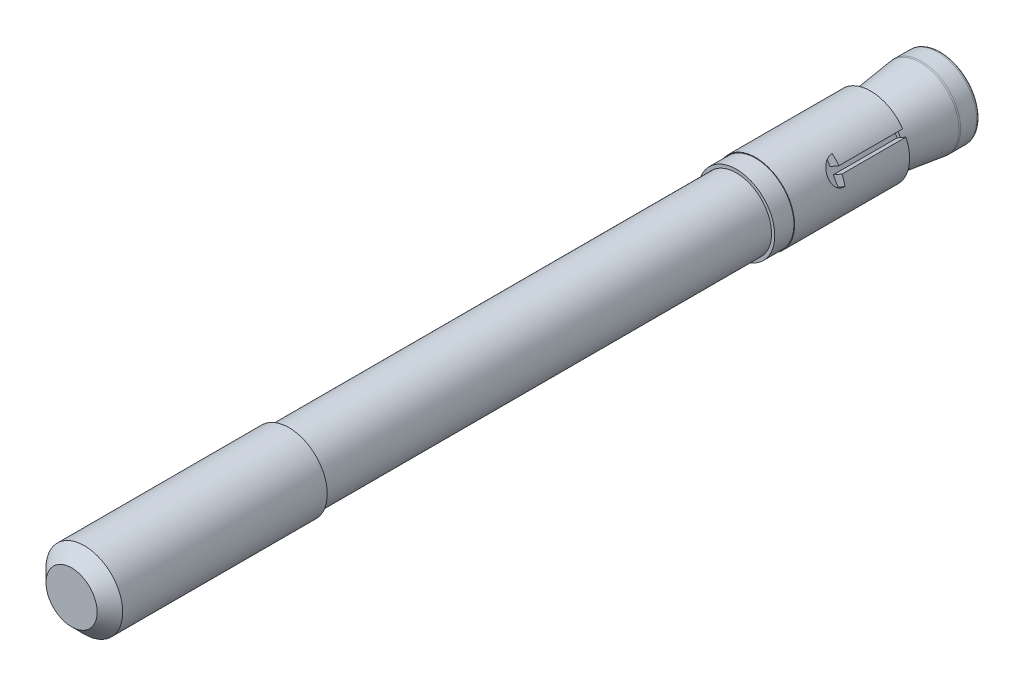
ISO-10303-21;
HEADER;
FILE_DESCRIPTION(('STEP AP214'),'2;1');
FILE_NAME('part.step','',(''),(''),'','','');
FILE_SCHEMA(('AUTOMOTIVE_DESIGN { 1 0 10303 214 1 1 1 1 }'));
ENDSEC;
DATA;
#1=APPLICATION_CONTEXT('core data for automotive mechanical design processes');
#2=APPLICATION_PROTOCOL_DEFINITION('international standard','automotive_design',2000,#1);
#3=PRODUCT_CONTEXT('',#1,'mechanical');
#4=PRODUCT('Part','Part','',(#3));
#5=PRODUCT_RELATED_PRODUCT_CATEGORY('part','',(#4));
#6=PRODUCT_DEFINITION_FORMATION('','',#4);
#7=PRODUCT_DEFINITION_CONTEXT('part definition',#1,'design');
#8=PRODUCT_DEFINITION('design','',#6,#7);
#9=PRODUCT_DEFINITION_SHAPE('','',#8);
#10=(LENGTH_UNIT() NAMED_UNIT(*) SI_UNIT(.MILLI.,.METRE.));
#11=(NAMED_UNIT(*) PLANE_ANGLE_UNIT() SI_UNIT($,.RADIAN.));
#12=(NAMED_UNIT(*) SI_UNIT($,.STERADIAN.) SOLID_ANGLE_UNIT());
#13=UNCERTAINTY_MEASURE_WITH_UNIT(LENGTH_MEASURE(1.E-05),#10,'distance_accuracy_value','');
#14=(GEOMETRIC_REPRESENTATION_CONTEXT(3) GLOBAL_UNCERTAINTY_ASSIGNED_CONTEXT((#13)) GLOBAL_UNIT_ASSIGNED_CONTEXT((#10,
#11,#12)) REPRESENTATION_CONTEXT('',''));
#15=CARTESIAN_POINT('',(0.,0.,0.));
#16=DIRECTION('',(0.,0.,1.));
#17=DIRECTION('',(1.,0.,0.));
#18=AXIS2_PLACEMENT_3D('',#15,#16,#17);
#19=CARTESIAN_POINT('',(0.,-3.0346052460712,-102.));
#20=DIRECTION('',(0.,0.,-1.));
#21=DIRECTION('',(-1.,0.,0.));
#22=AXIS2_PLACEMENT_3D('',#19,#20,#21);
#23=PLANE('',#22);
#24=CARTESIAN_POINT('',(0.,0.0102631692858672,-102.));
#25=DIRECTION('',(0.,0.,1.));
#26=DIRECTION('',(0.,-1.,0.));
#27=AXIS2_PLACEMENT_3D('',#24,#25,#26);
#28=CIRCLE('',#27,5.58973683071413);
#29=CARTESIAN_POINT('',(0.,-5.57947366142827,-102.));
#30=VERTEX_POINT('',#29);
#31=EDGE_CURVE('E310',#30,#30,#28,.T.);
#32=ORIENTED_EDGE('',*,*,#31,.F.);
#33=EDGE_LOOP('',(#32));
#34=FACE_BOUND('',#33,.T.);
#35=ADVANCED_FACE('F15',(#34),#23,.T.);
#36=CARTESIAN_POINT('',(0.,0.010263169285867,-101.5));
#37=DIRECTION('',(0.,0.,1.));
#38=DIRECTION('',(1.,0.,0.));
#39=AXIS2_PLACEMENT_3D('',#36,#37,#38);
#40=TOROIDAL_SURFACE('',#39,5.58973683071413,0.5);
#41=CARTESIAN_POINT('',(0.,0.0102631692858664,-101.5));
#42=DIRECTION('',(0.,0.,1.));
#43=DIRECTION('',(0.,-1.,0.));
#44=AXIS2_PLACEMENT_3D('',#41,#42,#43);
#45=CIRCLE('',#44,6.08973683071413);
#46=CARTESIAN_POINT('',(0.,-6.07947366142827,-101.5));
#47=VERTEX_POINT('',#46);
#48=EDGE_CURVE('E880',#47,#47,#45,.T.);
#49=ORIENTED_EDGE('',*,*,#48,.F.);
#50=EDGE_LOOP('',(#49));
#51=FACE_BOUND('',#50,.T.);
#52=ORIENTED_EDGE('',*,*,#31,.T.);
#53=EDGE_LOOP('',(#52));
#54=FACE_BOUND('',#53,.T.);
#55=ADVANCED_FACE('F294',(#51,#54),#40,.T.);
#56=CARTESIAN_POINT('',(0.,0.010263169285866,-100.5));
#57=DIRECTION('',(0.,0.,1.));
#58=DIRECTION('',(0.,-1.,0.));
#59=AXIS2_PLACEMENT_3D('',#56,#57,#58);
#60=CYLINDRICAL_SURFACE('',#59,6.08973683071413);
#61=ORIENTED_EDGE('',*,*,#48,.T.);
#62=EDGE_LOOP('',(#61));
#63=FACE_BOUND('',#62,.T.);
#64=CARTESIAN_POINT('',(0.,0.010263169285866,-99.));
#65=DIRECTION('',(0.,0.,1.));
#66=DIRECTION('',(1.,0.,0.));
#67=AXIS2_PLACEMENT_3D('',#64,#65,#66);
#68=CIRCLE('',#67,6.08973683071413);
#69=CARTESIAN_POINT('',(6.08973683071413,0.010263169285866,-99.));
#70=VERTEX_POINT('',#69);
#71=EDGE_CURVE('E272',#70,#70,#68,.T.);
#72=ORIENTED_EDGE('',*,*,#71,.F.);
#73=EDGE_LOOP('',(#72));
#74=FACE_BOUND('',#73,.T.);
#75=ADVANCED_FACE('F290',(#63,#74),#60,.T.);
#76=CARTESIAN_POINT('',(0.,0.010263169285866,-99.));
#77=DIRECTION('',(0.,0.,1.));
#78=DIRECTION('',(1.,0.,0.));
#79=AXIS2_PLACEMENT_3D('',#76,#77,#78);
#80=TOROIDAL_SURFACE('',#79,4.08973683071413,2.);
#81=ORIENTED_EDGE('',*,*,#71,.T.);
#82=EDGE_LOOP('',(#81));
#83=FACE_BOUND('',#82,.T.);
#84=CARTESIAN_POINT('',(0.,0.0102631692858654,-98.7480076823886));
#85=DIRECTION('',(0.,0.,-1.));
#86=DIRECTION('',(0.,-1.,0.));
#87=AXIS2_PLACEMENT_3D('',#84,#85,#86);
#88=CIRCLE('',#87,6.07379828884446);
#89=CARTESIAN_POINT('',(0.,-6.06353511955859,-98.7480076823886));
#90=VERTEX_POINT('',#89);
#91=EDGE_CURVE('E280',#90,#90,#88,.F.);
#92=ORIENTED_EDGE('',*,*,#91,.F.);
#93=EDGE_LOOP('',(#92));
#94=FACE_BOUND('',#93,.T.);
#95=ADVANCED_FACE('F285',(#83,#94),#80,.T.);
#96=CARTESIAN_POINT('',(0.,-2.5346052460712,-91.));
#97=DIRECTION('',(0.,0.,1.));
#98=DIRECTION('',(1.,0.,0.));
#99=AXIS2_PLACEMENT_3D('',#96,#97,#98);
#100=PLANE('',#99);
#101=DIRECTION('',(-0.866025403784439,-0.5,0.));
#102=VECTOR('',#101,1.);
#103=CARTESIAN_POINT('',(3.64711431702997,2.68301270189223,-91.));
#104=LINE('',#103,#102);
#105=CARTESIAN_POINT('',(4.14171802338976,2.96857228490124,-90.9999999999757));
#106=VERTEX_POINT('',#105);
#107=CARTESIAN_POINT('',(3.64711431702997,2.68301270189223,-90.9999998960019));
#108=VERTEX_POINT('',#107);
#109=EDGE_CURVE('E261',#106,#108,#104,.T.);
#110=ORIENTED_EDGE('',*,*,#109,.T.);
#111=DIRECTION('',(-0.5,0.866025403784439,0.));
#112=VECTOR('',#111,1.);
#113=CARTESIAN_POINT('',(3.89711431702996,2.25000000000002,-90.9999996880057));
#114=LINE('',#113,#112);
#115=CARTESIAN_POINT('',(4.14711431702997,1.81698729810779,-90.9999996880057));
#116=VERTEX_POINT('',#115);
#117=EDGE_CURVE('E249',#116,#108,#114,.T.);
#118=ORIENTED_EDGE('',*,*,#117,.F.);
#119=DIRECTION('',(0.866025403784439,0.5,0.));
#120=VECTOR('',#119,1.);
#121=CARTESIAN_POINT('',(4.14711431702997,1.81698729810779,-90.9999996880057));
#122=LINE('',#121,#120);
#123=CARTESIAN_POINT('',(4.6401983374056,2.10166949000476,-90.9999998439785));
#124=VERTEX_POINT('',#123);
#125=EDGE_CURVE('E276',#116,#124,#122,.T.);
#126=ORIENTED_EDGE('',*,*,#125,.T.);
#127=CARTESIAN_POINT('',(0.,0.0102631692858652,-90.9999999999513));
#128=DIRECTION('',(0.,0.,-1.));
#129=DIRECTION('',(-1.,0.,0.));
#130=AXIS2_PLACEMENT_3D('',#127,#128,#129);
#131=CIRCLE('',#130,5.08973683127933);
#132=EDGE_CURVE('E706',#106,#124,#131,.T.);
#133=ORIENTED_EDGE('',*,*,#132,.F.);
#134=EDGE_LOOP('',(#110,#118,#126,#133));
#135=FACE_BOUND('',#134,.T.);
#136=ADVANCED_FACE('F289',(#135),#100,.T.);
#137=CARTESIAN_POINT('',(3.89711431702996,2.25000000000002,-84.3941996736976));
#138=DIRECTION('',(0.866025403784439,0.5,0.));
#139=DIRECTION('',(-0.5,0.866025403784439,0.));
#140=AXIS2_PLACEMENT_3D('',#137,#138,#139);
#141=PLANE('',#140);
#142=DIRECTION('',(0.,0.,1.));
#143=VECTOR('',#142,1.);
#144=CARTESIAN_POINT('',(3.64711431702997,2.68301270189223,-80.9999996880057));
#145=LINE('',#144,#143);
#146=CARTESIAN_POINT('',(3.64711431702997,2.68301270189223,-80.9999996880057));
#147=VERTEX_POINT('',#146);
#148=EDGE_CURVE('E263',#108,#147,#145,.T.);
#149=ORIENTED_EDGE('',*,*,#148,.T.);
#150=DIRECTION('',(-0.5,0.866025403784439,0.));
#151=VECTOR('',#150,1.);
#152=CARTESIAN_POINT('',(3.64711431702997,2.68301270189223,-80.9999996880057));
#153=LINE('',#152,#151);
#154=CARTESIAN_POINT('',(2.89711431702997,3.98205080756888,-80.9999996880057));
#155=VERTEX_POINT('',#154);
#156=EDGE_CURVE('E265',#147,#155,#153,.T.);
#157=ORIENTED_EDGE('',*,*,#156,.T.);
#158=CARTESIAN_POINT('',(3.89711431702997,2.25,-80.9999996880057));
#159=DIRECTION('',(0.866025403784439,0.5,0.));
#160=DIRECTION('',(-0.5,0.866025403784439,0.));
#161=AXIS2_PLACEMENT_3D('',#158,#159,#160);
#162=CIRCLE('',#161,2.);
#163=CARTESIAN_POINT('',(4.89711431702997,0.517949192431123,-80.9999996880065));
#164=VERTEX_POINT('',#163);
#165=EDGE_CURVE('E702',#155,#164,#162,.T.);
#166=ORIENTED_EDGE('',*,*,#165,.T.);
#167=DIRECTION('',(-0.5,0.866025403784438,0.));
#168=VECTOR('',#167,1.);
#169=CARTESIAN_POINT('',(4.89711431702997,0.517949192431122,-80.9999996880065));
#170=LINE('',#169,#168);
#171=CARTESIAN_POINT('',(4.14711431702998,1.81698729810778,-80.9999996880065));
#172=VERTEX_POINT('',#171);
#173=EDGE_CURVE('E273',#164,#172,#170,.T.);
#174=ORIENTED_EDGE('',*,*,#173,.T.);
#175=DIRECTION('',(0.,0.,1.));
#176=VECTOR('',#175,1.);
#177=CARTESIAN_POINT('',(4.14711431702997,1.81698729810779,-90.9999996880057));
#178=LINE('',#177,#176);
#179=EDGE_CURVE('E277',#172,#116,#178,.F.);
#180=ORIENTED_EDGE('',*,*,#179,.T.);
#181=ORIENTED_EDGE('',*,*,#117,.T.);
#182=EDGE_LOOP('',(#149,#157,#166,#174,#180,#181));
#183=FACE_BOUND('',#182,.T.);
#184=ADVANCED_FACE('F455',(#183),#141,.T.);
#185=CARTESIAN_POINT('',(0.,-2.5346052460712,-91.));
#186=DIRECTION('',(0.,0.,1.));
#187=DIRECTION('',(1.,0.,0.));
#188=AXIS2_PLACEMENT_3D('',#185,#186,#187);
#189=PLANE('',#188);
#190=DIRECTION('',(-0.866025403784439,0.5,0.));
#191=VECTOR('',#190,1.);
#192=CARTESIAN_POINT('',(-3.64711431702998,2.68301270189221,-91.));
#193=LINE('',#192,#191);
#194=CARTESIAN_POINT('',(-3.64711431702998,2.68301270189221,-91.));
#195=VERTEX_POINT('',#194);
#196=CARTESIAN_POINT('',(-4.14171802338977,2.96857228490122,-90.9999999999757));
#197=VERTEX_POINT('',#196);
#198=EDGE_CURVE('E257',#195,#197,#193,.T.);
#199=ORIENTED_EDGE('',*,*,#198,.T.);
#200=CARTESIAN_POINT('',(0.,0.0102631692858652,-90.9999999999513));
#201=DIRECTION('',(0.,0.,-1.));
#202=DIRECTION('',(-1.,0.,0.));
#203=AXIS2_PLACEMENT_3D('',#200,#201,#202);
#204=CIRCLE('',#203,5.08973683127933);
#205=CARTESIAN_POINT('',(-4.64019833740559,2.10166949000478,-90.9999999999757));
#206=VERTEX_POINT('',#205);
#207=EDGE_CURVE('E762',#206,#197,#204,.T.);
#208=ORIENTED_EDGE('',*,*,#207,.F.);
#209=DIRECTION('',(0.866025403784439,-0.5,0.));
#210=VECTOR('',#209,1.);
#211=CARTESIAN_POINT('',(-4.14711431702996,1.81698729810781,-91.));
#212=LINE('',#211,#210);
#213=CARTESIAN_POINT('',(-4.14711431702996,1.81698729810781,-91.));
#214=VERTEX_POINT('',#213);
#215=EDGE_CURVE('E237',#206,#214,#212,.T.);
#216=ORIENTED_EDGE('',*,*,#215,.T.);
#217=DIRECTION('',(0.5,0.866025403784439,0.));
#218=VECTOR('',#217,1.);
#219=CARTESIAN_POINT('',(-3.89711431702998,2.24999999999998,-91.));
#220=LINE('',#219,#218);
#221=EDGE_CURVE('E246',#214,#195,#220,.T.);
#222=ORIENTED_EDGE('',*,*,#221,.T.);
#223=EDGE_LOOP('',(#199,#208,#216,#222));
#224=FACE_BOUND('',#223,.T.);
#225=ADVANCED_FACE('F452',(#224),#189,.T.);
#226=CARTESIAN_POINT('',(-3.89711431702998,2.24999999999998,-84.3941999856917));
#227=DIRECTION('',(0.866025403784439,-0.5,0.));
#228=DIRECTION('',(0.5,0.866025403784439,0.));
#229=AXIS2_PLACEMENT_3D('',#226,#227,#228);
#230=PLANE('',#229);
#231=DIRECTION('',(-0.500000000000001,-0.866025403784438,0.));
#232=VECTOR('',#231,1.);
#233=CARTESIAN_POINT('',(-2.89711431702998,3.98205080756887,-81.));
#234=LINE('',#233,#232);
#235=CARTESIAN_POINT('',(-2.89711431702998,3.98205080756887,-81.));
#236=VERTEX_POINT('',#235);
#237=CARTESIAN_POINT('',(-3.64711431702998,2.68301270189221,-81.));
#238=VERTEX_POINT('',#237);
#239=EDGE_CURVE('E250',#236,#238,#234,.T.);
#240=ORIENTED_EDGE('',*,*,#239,.T.);
#241=DIRECTION('',(0.,0.,1.));
#242=VECTOR('',#241,1.);
#243=CARTESIAN_POINT('',(-3.64711431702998,2.68301270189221,-91.));
#244=LINE('',#243,#242);
#245=EDGE_CURVE('E254',#238,#195,#244,.F.);
#246=ORIENTED_EDGE('',*,*,#245,.T.);
#247=ORIENTED_EDGE('',*,*,#221,.F.);
#248=DIRECTION('',(0.,0.,1.));
#249=VECTOR('',#248,1.);
#250=CARTESIAN_POINT('',(-4.14711431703,1.81698729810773,-81.));
#251=LINE('',#250,#249);
#252=CARTESIAN_POINT('',(-4.14711431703,1.81698729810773,-81.));
#253=VERTEX_POINT('',#252);
#254=EDGE_CURVE('E239',#214,#253,#251,.T.);
#255=ORIENTED_EDGE('',*,*,#254,.T.);
#256=DIRECTION('',(-0.5,-0.866025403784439,0.));
#257=VECTOR('',#256,1.);
#258=CARTESIAN_POINT('',(-4.14711431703,1.81698729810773,-81.));
#259=LINE('',#258,#257);
#260=CARTESIAN_POINT('',(-4.89711431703,0.517949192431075,-81.));
#261=VERTEX_POINT('',#260);
#262=EDGE_CURVE('E241',#253,#261,#259,.T.);
#263=ORIENTED_EDGE('',*,*,#262,.T.);
#264=CARTESIAN_POINT('',(-3.89711431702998,2.24999999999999,-81.));
#265=DIRECTION('',(-0.866025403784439,0.5,0.));
#266=DIRECTION('',(-0.5,-0.866025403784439,0.));
#267=AXIS2_PLACEMENT_3D('',#264,#265,#266);
#268=CIRCLE('',#267,2.);
#269=EDGE_CURVE('E686',#261,#236,#268,.T.);
#270=ORIENTED_EDGE('',*,*,#269,.T.);
#271=EDGE_LOOP('',(#240,#246,#247,#255,#263,#270));
#272=FACE_BOUND('',#271,.T.);
#273=ADVANCED_FACE('F449',(#272),#230,.F.);
#274=CARTESIAN_POINT('',(0.,-2.5346052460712,-91.));
#275=DIRECTION('',(0.,0.,1.));
#276=DIRECTION('',(1.,0.,0.));
#277=AXIS2_PLACEMENT_3D('',#274,#275,#276);
#278=PLANE('',#277);
#279=DIRECTION('',(0.,1.,0.));
#280=VECTOR('',#279,1.);
#281=CARTESIAN_POINT('',(0.500000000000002,-4.5,-91.));
#282=LINE('',#281,#280);
#283=CARTESIAN_POINT('',(0.5,-5.05485489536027,-90.9999999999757));
#284=VERTEX_POINT('',#283);
#285=CARTESIAN_POINT('',(0.500000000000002,-4.5,-91.));
#286=VERTEX_POINT('',#285);
#287=EDGE_CURVE('E710',#284,#286,#282,.T.);
#288=ORIENTED_EDGE('',*,*,#287,.T.);
#289=DIRECTION('',(1.,0.,0.));
#290=VECTOR('',#289,1.);
#291=CARTESIAN_POINT('',(0.,-4.5,-91.));
#292=LINE('',#291,#290);
#293=CARTESIAN_POINT('',(-0.500000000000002,-4.5,-91.));
#294=VERTEX_POINT('',#293);
#295=EDGE_CURVE('E718',#286,#294,#292,.F.);
#296=ORIENTED_EDGE('',*,*,#295,.T.);
#297=DIRECTION('',(0.,1.,0.));
#298=VECTOR('',#297,1.);
#299=CARTESIAN_POINT('',(-0.500000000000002,-4.5,-91.));
#300=LINE('',#299,#298);
#301=CARTESIAN_POINT('',(-0.500000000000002,-5.05485489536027,-90.9999999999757));
#302=VERTEX_POINT('',#301);
#303=EDGE_CURVE('E234',#294,#302,#300,.F.);
#304=ORIENTED_EDGE('',*,*,#303,.T.);
#305=CARTESIAN_POINT('',(0.,0.0102631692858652,-90.9999999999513));
#306=DIRECTION('',(0.,0.,-1.));
#307=DIRECTION('',(-1.,0.,0.));
#308=AXIS2_PLACEMENT_3D('',#305,#306,#307);
#309=CIRCLE('',#308,5.08973683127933);
#310=EDGE_CURVE('E19',#284,#302,#309,.T.);
#311=ORIENTED_EDGE('',*,*,#310,.F.);
#312=EDGE_LOOP('',(#288,#296,#304,#311));
#313=FACE_BOUND('',#312,.T.);
#314=ADVANCED_FACE('F446',(#313),#278,.T.);
#315=CARTESIAN_POINT('',(0.,-4.5,-81.8452759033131));
#316=DIRECTION('',(0.,1.,0.));
#317=DIRECTION('',(0.,0.,1.));
#318=AXIS2_PLACEMENT_3D('',#315,#316,#317);
#319=PLANE('',#318);
#320=DIRECTION('',(0.,0.,1.));
#321=VECTOR('',#320,1.);
#322=CARTESIAN_POINT('',(-0.500000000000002,-4.5,-91.));
#323=LINE('',#322,#321);
#324=CARTESIAN_POINT('',(-0.499999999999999,-4.5,-81.));
#325=VERTEX_POINT('',#324);
#326=EDGE_CURVE('E231',#325,#294,#323,.F.);
#327=ORIENTED_EDGE('',*,*,#326,.T.);
#328=ORIENTED_EDGE('',*,*,#295,.F.);
#329=DIRECTION('',(0.,0.,-1.));
#330=VECTOR('',#329,1.);
#331=CARTESIAN_POINT('',(0.500000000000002,-4.5,-81.));
#332=LINE('',#331,#330);
#333=CARTESIAN_POINT('',(0.500000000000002,-4.5,-81.));
#334=VERTEX_POINT('',#333);
#335=EDGE_CURVE('E162',#286,#334,#332,.F.);
#336=ORIENTED_EDGE('',*,*,#335,.T.);
#337=DIRECTION('',(-1.,0.,0.));
#338=VECTOR('',#337,1.);
#339=CARTESIAN_POINT('',(2.,-4.5,-81.));
#340=LINE('',#339,#338);
#341=CARTESIAN_POINT('',(2.,-4.5,-81.));
#342=VERTEX_POINT('',#341);
#343=EDGE_CURVE('E713',#334,#342,#340,.F.);
#344=ORIENTED_EDGE('',*,*,#343,.T.);
#345=CARTESIAN_POINT('',(0.,-4.5,-81.));
#346=DIRECTION('',(0.,-1.,0.));
#347=DIRECTION('',(0.,0.,-1.));
#348=AXIS2_PLACEMENT_3D('',#345,#346,#347);
#349=CIRCLE('',#348,2.);
#350=CARTESIAN_POINT('',(0.499999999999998,-4.5,-79.0635083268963));
#351=VERTEX_POINT('',#350);
#352=EDGE_CURVE('E726',#342,#351,#349,.T.);
#353=ORIENTED_EDGE('',*,*,#352,.T.);
#354=DIRECTION('',(0.,0.,-1.));
#355=VECTOR('',#354,1.);
#356=CARTESIAN_POINT('',(0.5,-4.5,-73.));
#357=LINE('',#356,#355);
#358=CARTESIAN_POINT('',(0.5,-4.5,-73.));
#359=VERTEX_POINT('',#358);
#360=EDGE_CURVE('E720',#351,#359,#357,.F.);
#361=ORIENTED_EDGE('',*,*,#360,.T.);
#362=DIRECTION('',(1.,0.,0.));
#363=VECTOR('',#362,1.);
#364=CARTESIAN_POINT('',(0.,-4.5,-73.));
#365=LINE('',#364,#363);
#366=CARTESIAN_POINT('',(-0.5,-4.5,-73.));
#367=VERTEX_POINT('',#366);
#368=EDGE_CURVE('E248',#367,#359,#365,.T.);
#369=ORIENTED_EDGE('',*,*,#368,.F.);
#370=DIRECTION('',(0.,0.,1.));
#371=VECTOR('',#370,1.);
#372=CARTESIAN_POINT('',(-0.5,-4.5,-79.0635083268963));
#373=LINE('',#372,#371);
#374=CARTESIAN_POINT('',(-0.5,-4.5,-79.0635083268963));
#375=VERTEX_POINT('',#374);
#376=EDGE_CURVE('E221',#367,#375,#373,.F.);
#377=ORIENTED_EDGE('',*,*,#376,.T.);
#378=CARTESIAN_POINT('',(0.,-4.5,-81.));
#379=DIRECTION('',(0.,-1.,0.));
#380=DIRECTION('',(0.,0.,-1.));
#381=AXIS2_PLACEMENT_3D('',#378,#379,#380);
#382=CIRCLE('',#381,2.);
#383=CARTESIAN_POINT('',(-2.,-4.5,-81.));
#384=VERTEX_POINT('',#383);
#385=EDGE_CURVE('E737',#375,#384,#382,.T.);
#386=ORIENTED_EDGE('',*,*,#385,.T.);
#387=DIRECTION('',(-1.,0.,0.));
#388=VECTOR('',#387,1.);
#389=CARTESIAN_POINT('',(-0.499999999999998,-4.5,-81.));
#390=LINE('',#389,#388);
#391=EDGE_CURVE('E227',#384,#325,#390,.F.);
#392=ORIENTED_EDGE('',*,*,#391,.T.);
#393=EDGE_LOOP('',(#327,#328,#336,#344,#353,#361,#369,#377,#386,#392));
#394=FACE_BOUND('',#393,.T.);
#395=ADVANCED_FACE('F442',(#394),#319,.F.);
#396=CARTESIAN_POINT('',(0.,0.0102631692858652,-98.7480076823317));
#397=DIRECTION('',(0.,0.,-1.));
#398=DIRECTION('',(-1.,0.,0.));
#399=AXIS2_PLACEMENT_3D('',#396,#397,#398);
#400=CONICAL_SURFACE('',#399,6.07379828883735,0.126331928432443);
#401=ORIENTED_EDGE('',*,*,#91,.T.);
#402=EDGE_LOOP('',(#401));
#403=FACE_BOUND('',#402,.T.);
#404=ORIENTED_EDGE('',*,*,#132,.T.);
#405=CARTESIAN_POINT('',(0.,0.0102631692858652,-90.9999999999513));
#406=DIRECTION('',(0.,0.,-1.));
#407=DIRECTION('',(-1.,0.,0.));
#408=AXIS2_PLACEMENT_3D('',#405,#406,#407);
#409=CIRCLE('',#408,5.08973683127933);
#410=EDGE_CURVE('E779',#124,#284,#409,.T.);
#411=ORIENTED_EDGE('',*,*,#410,.T.);
#412=ORIENTED_EDGE('',*,*,#310,.T.);
#413=CARTESIAN_POINT('',(0.,0.0102631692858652,-90.9999999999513));
#414=DIRECTION('',(0.,0.,-1.));
#415=DIRECTION('',(-1.,0.,0.));
#416=AXIS2_PLACEMENT_3D('',#413,#414,#415);
#417=CIRCLE('',#416,5.08973683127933);
#418=EDGE_CURVE('E235',#302,#206,#417,.T.);
#419=ORIENTED_EDGE('',*,*,#418,.T.);
#420=ORIENTED_EDGE('',*,*,#207,.T.);
#421=CARTESIAN_POINT('',(0.,0.0102631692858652,-90.9999999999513));
#422=DIRECTION('',(0.,0.,-1.));
#423=DIRECTION('',(-1.,0.,0.));
#424=AXIS2_PLACEMENT_3D('',#421,#422,#423);
#425=CIRCLE('',#424,5.08973683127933);
#426=EDGE_CURVE('E258',#197,#106,#425,.T.);
#427=ORIENTED_EDGE('',*,*,#426,.T.);
#428=EDGE_LOOP('',(#404,#411,#412,#419,#420,#427));
#429=FACE_BOUND('',#428,.T.);
#430=ADVANCED_FACE('F438',(#403,#429),#400,.T.);
#431=CARTESIAN_POINT('',(4.14711431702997,1.81698729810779,-90.9999996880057));
#432=DIRECTION('',(0.5,-0.866025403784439,0.));
#433=DIRECTION('',(0.866025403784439,0.5,0.));
#434=AXIS2_PLACEMENT_3D('',#431,#432,#433);
#435=PLANE('',#434);
#436=DIRECTION('',(-0.866025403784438,-0.500000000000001,0.));
#437=VECTOR('',#436,1.);
#438=CARTESIAN_POINT('',(5.51497863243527,2.60672412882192,-91.));
#439=LINE('',#438,#437);
#440=CARTESIAN_POINT('',(5.51497863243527,2.60672412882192,-91.));
#441=VERTEX_POINT('',#440);
#442=EDGE_CURVE('E796',#441,#124,#439,.T.);
#443=ORIENTED_EDGE('',*,*,#442,.T.);
#444=ORIENTED_EDGE('',*,*,#125,.F.);
#445=ORIENTED_EDGE('',*,*,#179,.F.);
#446=DIRECTION('',(0.866025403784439,0.5,0.));
#447=VECTOR('',#446,1.);
#448=CARTESIAN_POINT('',(4.14711431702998,1.81698729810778,-80.9999996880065));
#449=LINE('',#448,#447);
#450=CARTESIAN_POINT('',(5.51497863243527,2.60672412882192,-80.9999996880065));
#451=VERTEX_POINT('',#450);
#452=EDGE_CURVE('E275',#172,#451,#449,.T.);
#453=ORIENTED_EDGE('',*,*,#452,.T.);
#454=DIRECTION('',(0.,0.,-1.));
#455=VECTOR('',#454,1.);
#456=CARTESIAN_POINT('',(5.51497863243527,2.60672412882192,-73.));
#457=LINE('',#456,#455);
#458=EDGE_CURVE('E802',#441,#451,#457,.F.);
#459=ORIENTED_EDGE('',*,*,#458,.F.);
#460=EDGE_LOOP('',(#443,#444,#445,#453,#459));
#461=FACE_BOUND('',#460,.T.);
#462=ADVANCED_FACE('F434',(#461),#435,.F.);
#463=CARTESIAN_POINT('',(4.14711431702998,1.81698729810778,-80.9999996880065));
#464=DIRECTION('',(0.,0.,-1.));
#465=DIRECTION('',(-1.,0.,0.));
#466=AXIS2_PLACEMENT_3D('',#463,#464,#465);
#467=PLANE('',#466);
#468=ORIENTED_EDGE('',*,*,#452,.F.);
#469=ORIENTED_EDGE('',*,*,#173,.F.);
#470=DIRECTION('',(0.866025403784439,0.5,0.));
#471=VECTOR('',#470,1.);
#472=CARTESIAN_POINT('',(4.89711431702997,0.517949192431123,-80.9999996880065));
#473=LINE('',#472,#471);
#474=CARTESIAN_POINT('',(5.99074142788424,1.1493550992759,-80.9999996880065));
#475=VERTEX_POINT('',#474);
#476=EDGE_CURVE('E267',#164,#475,#473,.T.);
#477=ORIENTED_EDGE('',*,*,#476,.T.);
#478=CARTESIAN_POINT('',(0.,0.,-80.9999996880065));
#479=DIRECTION('',(0.,0.,-1.));
#480=DIRECTION('',(-1.,0.,0.));
#481=AXIS2_PLACEMENT_3D('',#478,#479,#480);
#482=CIRCLE('',#481,6.1);
#483=EDGE_CURVE('E805',#451,#475,#482,.T.);
#484=ORIENTED_EDGE('',*,*,#483,.F.);
#485=EDGE_LOOP('',(#468,#469,#477,#484));
#486=FACE_BOUND('',#485,.T.);
#487=ADVANCED_FACE('F430',(#486),#467,.F.);
#488=CARTESIAN_POINT('',(3.89711431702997,2.25,-80.9999996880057));
#489=DIRECTION('',(0.866025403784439,0.5,0.));
#490=DIRECTION('',(-0.5,0.866025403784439,0.));
#491=AXIS2_PLACEMENT_3D('',#488,#489,#490);
#492=CYLINDRICAL_SURFACE('',#491,2.);
#493=ORIENTED_EDGE('',*,*,#476,.F.);
#494=ORIENTED_EDGE('',*,*,#165,.F.);
#495=DIRECTION('',(0.866025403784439,0.5,0.));
#496=VECTOR('',#495,1.);
#497=CARTESIAN_POINT('',(2.89711431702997,3.98205080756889,-80.9999996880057));
#498=LINE('',#497,#496);
#499=CARTESIAN_POINT('',(3.99074142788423,4.61345671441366,-80.9999996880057));
#500=VERTEX_POINT('',#499);
#501=EDGE_CURVE('E264',#155,#500,#498,.T.);
#502=ORIENTED_EDGE('',*,*,#501,.T.);
#503=CARTESIAN_POINT('',(5.99074142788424,1.1493550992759,-80.9999996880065));
#504=CARTESIAN_POINT('',(5.99073756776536,1.14935121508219,-80.9453629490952));
#505=CARTESIAN_POINT('',(5.9902950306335,1.15168426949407,-80.8907540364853));
#506=CARTESIAN_POINT('',(5.98850530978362,1.16096408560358,-80.7819586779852));
#507=CARTESIAN_POINT('',(5.98715836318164,1.16790963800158,-80.7277721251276));
#508=CARTESIAN_POINT('',(5.98173327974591,1.19550738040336,-80.5667572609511));
#509=CARTESIAN_POINT('',(5.97627125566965,1.22292164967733,-80.4610579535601));
#510=CARTESIAN_POINT('',(5.96119070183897,1.29441862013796,-80.2559260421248));
#511=CARTESIAN_POINT('',(5.95157432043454,1.33849270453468,-80.1564902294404));
#512=CARTESIAN_POINT('',(5.92749080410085,1.44140149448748,-79.966155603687));
#513=CARTESIAN_POINT('',(5.91302081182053,1.50024488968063,-79.8752618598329));
#514=CARTESIAN_POINT('',(5.87785438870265,1.6326876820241,-79.7012333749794));
#515=CARTESIAN_POINT('',(5.85696227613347,1.70672221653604,-79.6184694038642));
#516=CARTESIAN_POINT('',(5.80831635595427,1.86557038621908,-79.4663644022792));
#517=CARTESIAN_POINT('',(5.78056134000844,1.95038591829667,-79.3970257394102));
#518=CARTESIAN_POINT('',(5.71676337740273,2.13024261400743,-79.2720639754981));
#519=CARTESIAN_POINT('',(5.68052949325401,2.22548734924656,-79.2168298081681));
#520=CARTESIAN_POINT('',(5.59995410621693,2.42109093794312,-79.1242162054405));
#521=CARTESIAN_POINT('',(5.5556150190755,2.52144826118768,-79.0868314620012));
#522=CARTESIAN_POINT('',(5.46088343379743,2.72038121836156,-79.0322335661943));
#523=CARTESIAN_POINT('',(5.41074564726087,2.81890272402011,-79.0143823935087));
#524=CARTESIAN_POINT('',(5.30439542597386,3.01425695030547,-78.9973314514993));
#525=CARTESIAN_POINT('',(5.24818439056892,3.11109005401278,-78.9981273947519));
#526=CARTESIAN_POINT('',(5.13367327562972,3.29648734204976,-79.0179401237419));
#527=CARTESIAN_POINT('',(5.07553352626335,3.38522588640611,-79.0362640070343));
#528=CARTESIAN_POINT('',(4.95726953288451,3.55616178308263,-79.0894687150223));
#529=CARTESIAN_POINT('',(4.89714517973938,3.63835877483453,-79.1243504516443));
#530=CARTESIAN_POINT('',(4.77639380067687,3.79552617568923,-79.2100962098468));
#531=CARTESIAN_POINT('',(4.71577032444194,3.87038942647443,-79.2611610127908));
#532=CARTESIAN_POINT('',(4.59723645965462,4.01046742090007,-79.3776591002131));
#533=CARTESIAN_POINT('',(4.53932679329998,4.07567960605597,-79.4430961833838));
#534=CARTESIAN_POINT('',(4.42616274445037,4.19837694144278,-79.5899828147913));
#535=CARTESIAN_POINT('',(4.37114949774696,4.25537475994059,-79.6720260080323));
#536=CARTESIAN_POINT('',(4.26955327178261,4.35730517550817,-79.8480252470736));
#537=CARTESIAN_POINT('',(4.22297296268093,4.40223395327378,-79.9419850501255));
#538=CARTESIAN_POINT('',(4.14034784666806,4.48004424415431,-80.1408386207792));
#539=CARTESIAN_POINT('',(4.10445851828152,4.5127495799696,-80.2458662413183));
#540=CARTESIAN_POINT('',(4.04657393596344,4.56473189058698,-80.4627704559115));
#541=CARTESIAN_POINT('',(4.02455688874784,4.58402993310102,-80.5746360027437));
#542=CARTESIAN_POINT('',(4.00379399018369,4.60214018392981,-80.7396554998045));
#543=CARTESIAN_POINT('',(3.99890535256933,4.60638486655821,-80.7915459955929));
#544=CARTESIAN_POINT('',(3.99237979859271,4.61204025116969,-80.8956150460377));
#545=CARTESIAN_POINT('',(3.99073857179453,4.61345470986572,-80.9477931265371));
#546=CARTESIAN_POINT('',(3.99074142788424,4.61345671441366,-80.9999996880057));
#547=B_SPLINE_CURVE_WITH_KNOTS('',3,(#503,#504,#505,#506,#507,#508,#509,#510,#511,#512,#513,
#514,#515,#516,#517,#518,#519,#520,#521,#522,#523,#524,#525,#526,#527,#528,#529,#530,#531,#532,
#533,#534,#535,#536,#537,#538,#539,#540,#541,#542,#543,#544,#545,#546),.UNSPECIFIED.,.F.,.F.,(4,
2,2,2,2,2,2,2,2,2,2,2,2,2,2,2,2,2,2,2,2,4),(0.,0.16380430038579,0.327565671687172,
0.653857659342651,0.979981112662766,1.30629689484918,1.6437516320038,1.98126582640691,
2.32727103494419,2.6731732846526,3.00740500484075,3.34155987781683,3.66302854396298,
3.98451491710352,4.31015730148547,4.63588585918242,4.97645285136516,5.3171274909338,
5.66253852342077,6.00740555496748,6.16413252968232,6.32065133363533),.UNSPECIFIED.);
#548=EDGE_CURVE('E378',#475,#500,#547,.T.);
#549=ORIENTED_EDGE('',*,*,#548,.F.);
#550=EDGE_LOOP('',(#493,#494,#502,#549));
#551=FACE_BOUND('',#550,.T.);
#552=ADVANCED_FACE('F425',(#551),#492,.F.);
#553=CARTESIAN_POINT('',(2.89711431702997,3.98205080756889,-80.9999996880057));
#554=DIRECTION('',(0.,0.,-1.));
#555=DIRECTION('',(-1.,0.,0.));
#556=AXIS2_PLACEMENT_3D('',#553,#554,#555);
#557=PLANE('',#556);
#558=ORIENTED_EDGE('',*,*,#501,.F.);
#559=ORIENTED_EDGE('',*,*,#156,.F.);
#560=DIRECTION('',(-0.866025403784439,-0.5,0.));
#561=VECTOR('',#560,1.);
#562=CARTESIAN_POINT('',(3.64711431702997,2.68301270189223,-80.9999996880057));
#563=LINE('',#562,#561);
#564=CARTESIAN_POINT('',(5.01497863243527,3.47274953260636,-80.9999996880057));
#565=VERTEX_POINT('',#564);
#566=EDGE_CURVE('E269',#147,#565,#563,.F.);
#567=ORIENTED_EDGE('',*,*,#566,.T.);
#568=CARTESIAN_POINT('',(0.,0.,-80.9999996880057));
#569=DIRECTION('',(0.,0.,-1.));
#570=DIRECTION('',(-1.,0.,0.));
#571=AXIS2_PLACEMENT_3D('',#568,#569,#570);
#572=CIRCLE('',#571,6.1);
#573=EDGE_CURVE('E698',#500,#565,#572,.T.);
#574=ORIENTED_EDGE('',*,*,#573,.F.);
#575=EDGE_LOOP('',(#558,#559,#567,#574));
#576=FACE_BOUND('',#575,.T.);
#577=ADVANCED_FACE('F422',(#576),#557,.F.);
#578=CARTESIAN_POINT('',(3.64711431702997,2.68301270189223,-80.9999996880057));
#579=DIRECTION('',(-0.5,0.866025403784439,0.));
#580=DIRECTION('',(-0.866025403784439,-0.5,0.));
#581=AXIS2_PLACEMENT_3D('',#578,#579,#580);
#582=PLANE('',#581);
#583=ORIENTED_EDGE('',*,*,#566,.F.);
#584=ORIENTED_EDGE('',*,*,#148,.F.);
#585=ORIENTED_EDGE('',*,*,#109,.F.);
#586=DIRECTION('',(0.866025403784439,0.5,0.));
#587=VECTOR('',#586,1.);
#588=CARTESIAN_POINT('',(4.14171802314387,2.96857228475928,-91.));
#589=LINE('',#588,#587);
#590=CARTESIAN_POINT('',(5.01497863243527,3.47274953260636,-90.9999998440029));
#591=VERTEX_POINT('',#590);
#592=EDGE_CURVE('E693',#106,#591,#589,.T.);
#593=ORIENTED_EDGE('',*,*,#592,.T.);
#594=DIRECTION('',(0.,0.,-1.));
#595=VECTOR('',#594,1.);
#596=CARTESIAN_POINT('',(5.01497863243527,3.47274953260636,-73.));
#597=LINE('',#596,#595);
#598=EDGE_CURVE('E695',#565,#591,#597,.T.);
#599=ORIENTED_EDGE('',*,*,#598,.F.);
#600=EDGE_LOOP('',(#583,#584,#585,#593,#599));
#601=FACE_BOUND('',#600,.T.);
#602=ADVANCED_FACE('F418',(#601),#582,.F.);
#603=CARTESIAN_POINT('',(0.,0.,-91.));
#604=DIRECTION('',(0.,0.,1.));
#605=DIRECTION('',(1.,0.,0.));
#606=AXIS2_PLACEMENT_3D('',#603,#604,#605);
#607=PLANE('',#606);
#608=DIRECTION('',(-0.866025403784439,0.5,0.));
#609=VECTOR('',#608,1.);
#610=CARTESIAN_POINT('',(-3.64711431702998,2.68301270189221,-91.));
#611=LINE('',#610,#609);
#612=CARTESIAN_POINT('',(-5.01497863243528,3.47274953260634,-90.9999998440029));
#613=VERTEX_POINT('',#612);
#614=EDGE_CURVE('E253',#197,#613,#611,.T.);
#615=ORIENTED_EDGE('',*,*,#614,.T.);
#616=CARTESIAN_POINT('',(0.,0.,-90.9999996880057));
#617=DIRECTION('',(0.,0.,-1.));
#618=DIRECTION('',(-1.,0.,0.));
#619=AXIS2_PLACEMENT_3D('',#616,#617,#618);
#620=CIRCLE('',#619,6.1);
#621=EDGE_CURVE('E691',#591,#613,#620,.F.);
#622=ORIENTED_EDGE('',*,*,#621,.F.);
#623=ORIENTED_EDGE('',*,*,#592,.F.);
#624=ORIENTED_EDGE('',*,*,#426,.F.);
#625=EDGE_LOOP('',(#615,#622,#623,#624));
#626=FACE_BOUND('',#625,.T.);
#627=ADVANCED_FACE('F414',(#626),#607,.F.);
#628=CARTESIAN_POINT('',(-3.64711431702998,2.68301270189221,-91.));
#629=DIRECTION('',(0.5,0.866025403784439,0.));
#630=DIRECTION('',(-0.866025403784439,0.5,0.));
#631=AXIS2_PLACEMENT_3D('',#628,#629,#630);
#632=PLANE('',#631);
#633=ORIENTED_EDGE('',*,*,#614,.F.);
#634=ORIENTED_EDGE('',*,*,#198,.F.);
#635=ORIENTED_EDGE('',*,*,#245,.F.);
#636=DIRECTION('',(-0.866025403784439,0.5,0.));
#637=VECTOR('',#636,1.);
#638=CARTESIAN_POINT('',(-3.64711431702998,2.68301270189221,-81.));
#639=LINE('',#638,#637);
#640=CARTESIAN_POINT('',(-5.01497863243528,3.47274953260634,-81.));
#641=VERTEX_POINT('',#640);
#642=EDGE_CURVE('E252',#238,#641,#639,.T.);
#643=ORIENTED_EDGE('',*,*,#642,.T.);
#644=DIRECTION('',(0.,0.,-1.));
#645=VECTOR('',#644,1.);
#646=CARTESIAN_POINT('',(-5.01497863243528,3.47274953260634,-73.));
#647=LINE('',#646,#645);
#648=EDGE_CURVE('E688',#613,#641,#647,.F.);
#649=ORIENTED_EDGE('',*,*,#648,.F.);
#650=EDGE_LOOP('',(#633,#634,#635,#643,#649));
#651=FACE_BOUND('',#650,.T.);
#652=ADVANCED_FACE('F410',(#651),#632,.F.);
#653=CARTESIAN_POINT('',(-3.64711431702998,2.68301270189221,-81.));
#654=DIRECTION('',(0.,0.,-1.));
#655=DIRECTION('',(-1.,0.,0.));
#656=AXIS2_PLACEMENT_3D('',#653,#654,#655);
#657=PLANE('',#656);
#658=ORIENTED_EDGE('',*,*,#642,.F.);
#659=ORIENTED_EDGE('',*,*,#239,.F.);
#660=DIRECTION('',(-0.866025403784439,0.5,0.));
#661=VECTOR('',#660,1.);
#662=CARTESIAN_POINT('',(-2.89711431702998,3.98205080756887,-81.));
#663=LINE('',#662,#661);
#664=CARTESIAN_POINT('',(-3.99074142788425,4.61345671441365,-81.));
#665=VERTEX_POINT('',#664);
#666=EDGE_CURVE('E243',#236,#665,#663,.T.);
#667=ORIENTED_EDGE('',*,*,#666,.T.);
#668=CARTESIAN_POINT('',(0.,0.,-81.));
#669=DIRECTION('',(0.,0.,-1.));
#670=DIRECTION('',(-1.,0.,0.));
#671=AXIS2_PLACEMENT_3D('',#668,#669,#670);
#672=CIRCLE('',#671,6.1);
#673=EDGE_CURVE('E396',#641,#665,#672,.T.);
#674=ORIENTED_EDGE('',*,*,#673,.F.);
#675=EDGE_LOOP('',(#658,#659,#667,#674));
#676=FACE_BOUND('',#675,.T.);
#677=ADVANCED_FACE('F405',(#676),#657,.F.);
#678=CARTESIAN_POINT('',(-3.89711431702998,2.24999999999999,-81.));
#679=DIRECTION('',(-0.866025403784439,0.5,0.));
#680=DIRECTION('',(-0.5,-0.866025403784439,0.));
#681=AXIS2_PLACEMENT_3D('',#678,#679,#680);
#682=CYLINDRICAL_SURFACE('',#681,2.);
#683=ORIENTED_EDGE('',*,*,#666,.F.);
#684=ORIENTED_EDGE('',*,*,#269,.F.);
#685=DIRECTION('',(-0.866025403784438,0.500000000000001,0.));
#686=VECTOR('',#685,1.);
#687=CARTESIAN_POINT('',(-4.89711431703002,0.517949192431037,-81.));
#688=LINE('',#687,#686);
#689=CARTESIAN_POINT('',(-5.99074142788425,1.14935509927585,-81.));
#690=VERTEX_POINT('',#689);
#691=EDGE_CURVE('E240',#261,#690,#688,.T.);
#692=ORIENTED_EDGE('',*,*,#691,.T.);
#693=CARTESIAN_POINT('',(-3.99074142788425,4.61345671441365,-81.));
#694=CARTESIAN_POINT('',(-3.9907361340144,4.61345531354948,-80.9453632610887));
#695=CARTESIAN_POINT('',(-3.99253534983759,4.61190553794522,-80.8907543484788));
#696=CARTESIAN_POINT('',(-3.99967704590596,4.60571568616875,-80.7819589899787));
#697=CARTESIAN_POINT('',(-4.00501859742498,4.60107641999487,-80.7277724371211));
#698=CARTESIAN_POINT('',(-4.02620640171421,4.58257928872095,-80.5667575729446));
#699=CARTESIAN_POINT('',(-4.04721684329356,4.5641419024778,-80.4610582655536));
#700=CARTESIAN_POINT('',(-4.10159475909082,4.51533327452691,-80.2559263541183));
#701=CARTESIAN_POINT('',(-4.13495584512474,4.4849682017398,-80.1564905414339));
#702=CARTESIAN_POINT('',(-4.2120357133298,4.4126568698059,-79.9661559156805));
#703=CARTESIAN_POINT('',(-4.25576059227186,4.37070379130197,-79.8752621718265));
#704=CARTESIAN_POINT('',(-4.35287620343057,4.27402737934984,-79.701233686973));
#705=CARTESIAN_POINT('',(-4.4065459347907,4.2189170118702,-79.6184697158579));
#706=CARTESIAN_POINT('',(-4.51978952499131,4.09736432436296,-79.4663647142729));
#707=CARTESIAN_POINT('',(-4.5793644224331,4.0309200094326,-79.397026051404));
#708=CARTESIAN_POINT('',(-4.70322590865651,3.88574100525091,-79.272064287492));
#709=CARTESIAN_POINT('',(-4.76759332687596,3.80673917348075,-79.216830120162));
#710=CARTESIAN_POINT('',(-4.89670331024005,3.63915704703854,-79.1242165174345));
#711=CARTESIAN_POINT('',(-4.96144575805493,3.55057960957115,-79.0868317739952));
#712=CARTESIAN_POINT('',(-5.08636095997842,3.36907317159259,-79.0322338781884));
#713=CARTESIAN_POINT('',(-5.14661419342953,3.27639182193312,-79.0143827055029));
#714=CARTESIAN_POINT('',(-5.26262080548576,3.08661271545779,-78.9973317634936));
#715=CARTESIAN_POINT('',(-5.31837521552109,2.98951597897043,-78.9981277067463));
#716=CARTESIAN_POINT('',(-5.42167841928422,2.79764780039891,-79.0179404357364));
#717=CARTESIAN_POINT('',(-5.46945837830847,2.7029280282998,-79.0362643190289));
#718=CARTESIAN_POINT('',(-5.55836121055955,2.51504045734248,-79.0894690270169));
#719=CARTESIAN_POINT('',(-5.59948371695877,2.42187274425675,-79.124350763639));
#720=CARTESIAN_POINT('',(-5.67521898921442,2.23871528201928,-79.2100965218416));
#721=CARTESIAN_POINT('',(-5.7097407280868,2.14878218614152,-79.2611613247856));
#722=CARTESIAN_POINT('',(-5.77178489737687,1.97608985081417,-79.377659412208));
#723=CARTESIAN_POINT('',(-5.79930547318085,1.89333251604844,-79.4430964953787));
#724=CARTESIAN_POINT('',(-5.84898245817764,1.73398090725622,-79.5899831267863));
#725=CARTESIAN_POINT('',(-5.87083739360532,1.65783912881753,-79.6720263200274));
#726=CARTESIAN_POINT('',(-5.90831360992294,1.51888900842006,-79.8480255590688));
#727=CARTESIAN_POINT('',(-5.92393291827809,1.4560848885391,-79.9419853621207));
#728=CARTESIAN_POINT('',(-5.95000604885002,1.34562429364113,-80.1408389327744));
#729=CARTESIAN_POINT('',(-5.96038503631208,1.29819055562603,-80.2458665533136));
#730=CARTESIAN_POINT('',(-5.97646074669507,1.22206988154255,-80.4627707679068));
#731=CARTESIAN_POINT('',(-5.98216481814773,1.19335353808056,-80.574636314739));
#732=CARTESIAN_POINT('',(-5.98746730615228,1.16631721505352,-80.7396558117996));
#733=CARTESIAN_POINT('',(-5.98869899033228,1.15996118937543,-80.7915463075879));
#734=CARTESIAN_POINT('',(-5.99033392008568,1.15148220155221,-80.8956153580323));
#735=CARTESIAN_POINT('',(-5.99073826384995,1.14935362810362,-80.9477934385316));
#736=CARTESIAN_POINT('',(-5.99074142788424,1.14935509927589,-81.));
#737=B_SPLINE_CURVE_WITH_KNOTS('',3,(#693,#694,#695,#696,#697,#698,#699,#700,#701,#702,#703,
#704,#705,#706,#707,#708,#709,#710,#711,#712,#713,#714,#715,#716,#717,#718,#719,#720,#721,#722,
#723,#724,#725,#726,#727,#728,#729,#730,#731,#732,#733,#734,#735,#736),.UNSPECIFIED.,.F.,.F.,(4,
2,2,2,2,2,2,2,2,2,2,2,2,2,2,2,2,2,2,2,2,4),(0.,0.163804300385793,0.327565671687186,
0.653857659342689,0.97998111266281,1.30629689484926,1.6437516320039,1.98126582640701,
2.3272710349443,2.67317328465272,3.00740500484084,3.34155987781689,3.66302854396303,
3.98451491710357,4.31015730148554,4.63588585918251,4.97645285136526,5.31712749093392,
5.66253852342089,6.00740555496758,6.16413252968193,6.32065133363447),.UNSPECIFIED.);
#738=EDGE_CURVE('E387',#665,#690,#737,.T.);
#739=ORIENTED_EDGE('',*,*,#738,.F.);
#740=EDGE_LOOP('',(#683,#684,#692,#739));
#741=FACE_BOUND('',#740,.T.);
#742=ADVANCED_FACE('F399',(#741),#682,.F.);
#743=CARTESIAN_POINT('',(-4.89711431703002,0.517949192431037,-81.));
#744=DIRECTION('',(0.,0.,-1.));
#745=DIRECTION('',(-1.,0.,0.));
#746=AXIS2_PLACEMENT_3D('',#743,#744,#745);
#747=PLANE('',#746);
#748=ORIENTED_EDGE('',*,*,#691,.F.);
#749=ORIENTED_EDGE('',*,*,#262,.F.);
#750=DIRECTION('',(0.866025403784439,-0.5,0.));
#751=VECTOR('',#750,1.);
#752=CARTESIAN_POINT('',(-4.14711431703,1.81698729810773,-81.));
#753=LINE('',#752,#751);
#754=CARTESIAN_POINT('',(-5.5149786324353,2.60672412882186,-81.));
#755=VERTEX_POINT('',#754);
#756=EDGE_CURVE('E245',#253,#755,#753,.F.);
#757=ORIENTED_EDGE('',*,*,#756,.T.);
#758=CARTESIAN_POINT('',(0.,0.,-81.));
#759=DIRECTION('',(0.,0.,-1.));
#760=DIRECTION('',(-1.,0.,0.));
#761=AXIS2_PLACEMENT_3D('',#758,#759,#760);
#762=CIRCLE('',#761,6.1);
#763=EDGE_CURVE('E395',#690,#755,#762,.T.);
#764=ORIENTED_EDGE('',*,*,#763,.F.);
#765=EDGE_LOOP('',(#748,#749,#757,#764));
#766=FACE_BOUND('',#765,.T.);
#767=ADVANCED_FACE('F404',(#766),#747,.F.);
#768=CARTESIAN_POINT('',(-4.14711431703,1.81698729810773,-81.));
#769=DIRECTION('',(-0.5,-0.866025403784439,0.));
#770=DIRECTION('',(0.866025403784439,-0.5,0.));
#771=AXIS2_PLACEMENT_3D('',#768,#769,#770);
#772=PLANE('',#771);
#773=ORIENTED_EDGE('',*,*,#756,.F.);
#774=ORIENTED_EDGE('',*,*,#254,.F.);
#775=ORIENTED_EDGE('',*,*,#215,.F.);
#776=DIRECTION('',(-0.866025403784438,0.5,0.));
#777=VECTOR('',#776,1.);
#778=CARTESIAN_POINT('',(-4.64019833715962,2.10166948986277,-91.));
#779=LINE('',#778,#777);
#780=CARTESIAN_POINT('',(-5.51497863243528,2.6067241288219,-91.));
#781=VERTEX_POINT('',#780);
#782=EDGE_CURVE('E745',#206,#781,#779,.T.);
#783=ORIENTED_EDGE('',*,*,#782,.T.);
#784=DIRECTION('',(0.,0.,-1.));
#785=VECTOR('',#784,1.);
#786=CARTESIAN_POINT('',(-5.5149786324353,2.60672412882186,-73.));
#787=LINE('',#786,#785);
#788=EDGE_CURVE('E746',#755,#781,#787,.T.);
#789=ORIENTED_EDGE('',*,*,#788,.F.);
#790=EDGE_LOOP('',(#773,#774,#775,#783,#789));
#791=FACE_BOUND('',#790,.T.);
#792=ADVANCED_FACE('F577',(#791),#772,.F.);
#793=CARTESIAN_POINT('',(0.,0.,-91.));
#794=DIRECTION('',(0.,0.,1.));
#795=DIRECTION('',(1.,0.,0.));
#796=AXIS2_PLACEMENT_3D('',#793,#794,#795);
#797=PLANE('',#796);
#798=DIRECTION('',(0.,1.,0.));
#799=VECTOR('',#798,1.);
#800=CARTESIAN_POINT('',(-0.500000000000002,-4.5,-91.));
#801=LINE('',#800,#799);
#802=CARTESIAN_POINT('',(-0.500000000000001,-6.07947366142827,-91.));
#803=VERTEX_POINT('',#802);
#804=EDGE_CURVE('E230',#302,#803,#801,.F.);
#805=ORIENTED_EDGE('',*,*,#804,.T.);
#806=CARTESIAN_POINT('',(0.,0.,-91.));
#807=DIRECTION('',(0.,0.,-1.));
#808=DIRECTION('',(-1.,0.,0.));
#809=AXIS2_PLACEMENT_3D('',#806,#807,#808);
#810=CIRCLE('',#809,6.1);
#811=EDGE_CURVE('E743',#781,#803,#810,.F.);
#812=ORIENTED_EDGE('',*,*,#811,.F.);
#813=ORIENTED_EDGE('',*,*,#782,.F.);
#814=ORIENTED_EDGE('',*,*,#418,.F.);
#815=EDGE_LOOP('',(#805,#812,#813,#814));
#816=FACE_BOUND('',#815,.T.);
#817=ADVANCED_FACE('F569',(#816),#797,.F.);
#818=CARTESIAN_POINT('',(-0.500000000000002,-4.5,-91.));
#819=DIRECTION('',(-1.,0.,0.));
#820=DIRECTION('',(0.,0.,1.));
#821=AXIS2_PLACEMENT_3D('',#818,#819,#820);
#822=PLANE('',#821);
#823=ORIENTED_EDGE('',*,*,#804,.F.);
#824=ORIENTED_EDGE('',*,*,#303,.F.);
#825=ORIENTED_EDGE('',*,*,#326,.F.);
#826=DIRECTION('',(0.,1.,0.));
#827=VECTOR('',#826,1.);
#828=CARTESIAN_POINT('',(-0.499999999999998,-4.5,-81.));
#829=LINE('',#828,#827);
#830=CARTESIAN_POINT('',(-0.499999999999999,-6.07947366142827,-81.));
#831=VERTEX_POINT('',#830);
#832=EDGE_CURVE('E229',#325,#831,#829,.F.);
#833=ORIENTED_EDGE('',*,*,#832,.T.);
#834=DIRECTION('',(0.,0.,-1.));
#835=VECTOR('',#834,1.);
#836=CARTESIAN_POINT('',(-0.499999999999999,-6.07947366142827,-73.));
#837=LINE('',#836,#835);
#838=EDGE_CURVE('E739',#803,#831,#837,.F.);
#839=ORIENTED_EDGE('',*,*,#838,.F.);
#840=EDGE_LOOP('',(#823,#824,#825,#833,#839));
#841=FACE_BOUND('',#840,.T.);
#842=ADVANCED_FACE('F561',(#841),#822,.F.);
#843=CARTESIAN_POINT('',(-0.499999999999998,-4.5,-81.));
#844=DIRECTION('',(0.,0.,-1.));
#845=DIRECTION('',(-1.,0.,0.));
#846=AXIS2_PLACEMENT_3D('',#843,#844,#845);
#847=PLANE('',#846);
#848=ORIENTED_EDGE('',*,*,#832,.F.);
#849=ORIENTED_EDGE('',*,*,#391,.F.);
#850=DIRECTION('',(0.,-1.,0.));
#851=VECTOR('',#850,1.);
#852=CARTESIAN_POINT('',(-2.,-4.5,-81.));
#853=LINE('',#852,#851);
#854=CARTESIAN_POINT('',(-2.,-5.76281181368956,-81.));
#855=VERTEX_POINT('',#854);
#856=EDGE_CURVE('E202',#384,#855,#853,.T.);
#857=ORIENTED_EDGE('',*,*,#856,.T.);
#858=CARTESIAN_POINT('',(0.,0.,-81.));
#859=DIRECTION('',(0.,0.,-1.));
#860=DIRECTION('',(-1.,0.,0.));
#861=AXIS2_PLACEMENT_3D('',#858,#859,#860);
#862=CIRCLE('',#861,6.1);
#863=EDGE_CURVE('E742',#831,#855,#862,.T.);
#864=ORIENTED_EDGE('',*,*,#863,.F.);
#865=EDGE_LOOP('',(#848,#849,#857,#864));
#866=FACE_BOUND('',#865,.T.);
#867=ADVANCED_FACE('F554',(#866),#847,.F.);
#868=CARTESIAN_POINT('',(0.,-4.5,-81.));
#869=DIRECTION('',(0.,-1.,0.));
#870=DIRECTION('',(0.,0.,-1.));
#871=AXIS2_PLACEMENT_3D('',#868,#869,#870);
#872=CYLINDRICAL_SURFACE('',#871,2.);
#873=ORIENTED_EDGE('',*,*,#856,.F.);
#874=ORIENTED_EDGE('',*,*,#385,.F.);
#875=DIRECTION('',(0.,1.,0.));
#876=VECTOR('',#875,1.);
#877=CARTESIAN_POINT('',(-0.5,-4.5,-79.0635083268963));
#878=LINE('',#877,#876);
#879=CARTESIAN_POINT('',(-0.5,-6.07947366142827,-79.0635083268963));
#880=VERTEX_POINT('',#879);
#881=EDGE_CURVE('E223',#375,#880,#878,.F.);
#882=ORIENTED_EDGE('',*,*,#881,.T.);
#883=CARTESIAN_POINT('',(-2.,-5.76281181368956,-81.));
#884=CARTESIAN_POINT('',(-2.00000143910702,-5.76280652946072,-80.9453648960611));
#885=CARTESIAN_POINT('',(-1.99775981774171,-5.76358976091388,-80.8907576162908));
#886=CARTESIAN_POINT('',(-1.98882892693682,-5.76667954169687,-80.7819654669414));
#887=CARTESIAN_POINT('',(-1.98214082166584,-5.76898569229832,-80.7277804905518));
#888=CARTESIAN_POINT('',(-1.95552846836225,-5.77808613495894,-80.5667638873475));
#889=CARTESIAN_POINT('',(-1.92905551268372,-5.78706321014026,-80.4610613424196));
#890=CARTESIAN_POINT('',(-1.85959634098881,-5.809751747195,-80.2559277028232));
#891=CARTESIAN_POINT('',(-1.81661937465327,-5.82346055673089,-80.1564931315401));
#892=CARTESIAN_POINT('',(-1.7154569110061,-5.85405789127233,-79.9661584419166));
#893=CARTESIAN_POINT('',(-1.65726205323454,-5.87094837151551,-79.8752636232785));
#894=CARTESIAN_POINT('',(-1.524965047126,-5.90671842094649,-79.7012173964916));
#895=CARTESIAN_POINT('',(-1.45038564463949,-5.92564635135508,-79.618438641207));
#896=CARTESIAN_POINT('',(-1.28849887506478,-5.96294110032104,-79.4663406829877));
#897=CARTESIAN_POINT('',(-1.20119386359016,-5.98130802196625,-79.3970189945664));
#898=CARTESIAN_POINT('',(-1.01609670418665,-6.0155091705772,-79.2737734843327));
#899=CARTESIAN_POINT('',(-0.918330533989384,-6.0313494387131,-79.2198126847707));
#900=CARTESIAN_POINT('',(-0.765623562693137,-6.05198166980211,-79.1515005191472));
#901=CARTESIAN_POINT('',(-0.713644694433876,-6.0583435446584,-79.1308171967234));
#902=CARTESIAN_POINT('',(-0.608002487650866,-6.06985701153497,-79.0938353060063));
#903=CARTESIAN_POINT('',(-0.554338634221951,-6.07500822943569,-79.0775380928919));
#904=CARTESIAN_POINT('',(-0.499999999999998,-6.07947366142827,-79.0635083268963));
#905=B_SPLINE_CURVE_WITH_KNOTS('',3,(#883,#884,#885,#886,#887,#888,#889,#890,#891,#892,#893,
#894,#895,#896,#897,#898,#899,#900,#901,#902,#903,#904),.UNSPECIFIED.,.F.,.F.,(4,2,2,2,2,2,2,2,
2,2,4),(0.,0.163799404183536,0.327555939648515,0.653857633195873,0.979976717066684,
1.30629686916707,1.64381253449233,1.98126580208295,2.31789972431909,2.48662764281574,
2.65540763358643),.UNSPECIFIED.);
#906=EDGE_CURVE('E355',#855,#880,#905,.T.);
#907=ORIENTED_EDGE('',*,*,#906,.F.);
#908=EDGE_LOOP('',(#873,#874,#882,#907));
#909=FACE_BOUND('',#908,.T.);
#910=ADVANCED_FACE('F547',(#909),#872,.F.);
#911=CARTESIAN_POINT('',(-0.5,-4.5,-79.0635083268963));
#912=DIRECTION('',(-1.,0.,0.));
#913=DIRECTION('',(0.,0.,1.));
#914=AXIS2_PLACEMENT_3D('',#911,#912,#913);
#915=PLANE('',#914);
#916=ORIENTED_EDGE('',*,*,#881,.F.);
#917=ORIENTED_EDGE('',*,*,#376,.F.);
#918=DIRECTION('',(0.,1.,0.));
#919=VECTOR('',#918,1.);
#920=CARTESIAN_POINT('',(-0.5,-4.5,-73.));
#921=LINE('',#920,#919);
#922=CARTESIAN_POINT('',(-0.500000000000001,-5.9791303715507,-73.));
#923=VERTEX_POINT('',#922);
#924=EDGE_CURVE('E201',#923,#367,#921,.T.);
#925=ORIENTED_EDGE('',*,*,#924,.F.);
#926=DIRECTION('',(0.,1.,0.));
#927=VECTOR('',#926,1.);
#928=CARTESIAN_POINT('',(-0.5,-4.5,-73.));
#929=LINE('',#928,#927);
#930=CARTESIAN_POINT('',(-0.5,-6.07947366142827,-73.));
#931=VERTEX_POINT('',#930);
#932=EDGE_CURVE('E34',#931,#923,#929,.T.);
#933=ORIENTED_EDGE('',*,*,#932,.F.);
#934=DIRECTION('',(0.,0.,-1.));
#935=VECTOR('',#934,1.);
#936=CARTESIAN_POINT('',(-0.499999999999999,-6.07947366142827,-73.));
#937=LINE('',#936,#935);
#938=EDGE_CURVE('E791',#880,#931,#937,.F.);
#939=ORIENTED_EDGE('',*,*,#938,.F.);
#940=EDGE_LOOP('',(#916,#917,#925,#933,#939));
#941=FACE_BOUND('',#940,.T.);
#942=ADVANCED_FACE('F220',(#941),#915,.F.);
#943=CARTESIAN_POINT('',(0.5,-4.5,-73.));
#944=DIRECTION('',(1.,0.,0.));
#945=DIRECTION('',(0.,0.,-1.));
#946=AXIS2_PLACEMENT_3D('',#943,#944,#945);
#947=PLANE('',#946);
#948=DIRECTION('',(0.,1.,0.));
#949=VECTOR('',#948,1.);
#950=CARTESIAN_POINT('',(0.5,-4.5,-73.));
#951=LINE('',#950,#949);
#952=CARTESIAN_POINT('',(0.500000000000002,-5.9791303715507,-73.));
#953=VERTEX_POINT('',#952);
#954=CARTESIAN_POINT('',(0.500000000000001,-6.07947366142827,-73.));
#955=VERTEX_POINT('',#954);
#956=EDGE_CURVE('E723',#953,#955,#951,.F.);
#957=ORIENTED_EDGE('',*,*,#956,.F.);
#958=DIRECTION('',(0.,1.,0.));
#959=VECTOR('',#958,1.);
#960=CARTESIAN_POINT('',(0.5,-4.5,-73.));
#961=LINE('',#960,#959);
#962=EDGE_CURVE('E215',#359,#953,#961,.F.);
#963=ORIENTED_EDGE('',*,*,#962,.F.);
#964=ORIENTED_EDGE('',*,*,#360,.F.);
#965=DIRECTION('',(0.,-1.,0.));
#966=VECTOR('',#965,1.);
#967=CARTESIAN_POINT('',(0.499999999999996,-4.5,-79.0635083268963));
#968=LINE('',#967,#966);
#969=CARTESIAN_POINT('',(0.499999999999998,-6.07947366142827,-79.0635083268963));
#970=VERTEX_POINT('',#969);
#971=EDGE_CURVE('E715',#351,#970,#968,.T.);
#972=ORIENTED_EDGE('',*,*,#971,.T.);
#973=DIRECTION('',(0.,0.,-1.));
#974=VECTOR('',#973,1.);
#975=CARTESIAN_POINT('',(0.500000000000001,-6.07947366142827,-73.));
#976=LINE('',#975,#974);
#977=EDGE_CURVE('E354',#955,#970,#976,.T.);
#978=ORIENTED_EDGE('',*,*,#977,.F.);
#979=EDGE_LOOP('',(#957,#963,#964,#972,#978));
#980=FACE_BOUND('',#979,.T.);
#981=ADVANCED_FACE('F534',(#980),#947,.F.);
#982=CARTESIAN_POINT('',(0.,-4.5,-81.));
#983=DIRECTION('',(0.,-1.,0.));
#984=DIRECTION('',(0.,0.,-1.));
#985=AXIS2_PLACEMENT_3D('',#982,#983,#984);
#986=CYLINDRICAL_SURFACE('',#985,2.);
#987=ORIENTED_EDGE('',*,*,#971,.F.);
#988=ORIENTED_EDGE('',*,*,#352,.F.);
#989=DIRECTION('',(0.,1.,0.));
#990=VECTOR('',#989,1.);
#991=CARTESIAN_POINT('',(2.,-4.5,-81.));
#992=LINE('',#991,#990);
#993=CARTESIAN_POINT('',(2.,-5.76281181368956,-81.));
#994=VERTEX_POINT('',#993);
#995=EDGE_CURVE('E712',#342,#994,#992,.F.);
#996=ORIENTED_EDGE('',*,*,#995,.T.);
#997=CARTESIAN_POINT('',(0.499999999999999,-6.07947366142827,-79.0635083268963));
#998=CARTESIAN_POINT('',(0.554503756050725,-6.07499469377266,-79.0775807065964));
#999=CARTESIAN_POINT('',(0.608328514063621,-6.06982572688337,-79.0939343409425));
#1000=CARTESIAN_POINT('',(0.714281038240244,-6.05826991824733,-79.1310551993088));
#1001=CARTESIAN_POINT('',(0.766409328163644,-6.05188345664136,-79.1518210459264));
#1002=CARTESIAN_POINT('',(0.919521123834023,-6.03117256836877,-79.2204077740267));
#1003=CARTESIAN_POINT('',(1.01752338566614,-6.01527122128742,-79.274593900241));
#1004=CARTESIAN_POINT('',(1.20272235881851,-5.98099939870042,-79.3981686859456));
#1005=CARTESIAN_POINT('',(1.28992731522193,-5.96263082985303,-79.4675456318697));
#1006=CARTESIAN_POINT('',(1.45163032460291,-5.92534047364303,-79.6197474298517));
#1007=CARTESIAN_POINT('',(1.52612286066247,-5.90641845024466,-79.7025780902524));
#1008=CARTESIAN_POINT('',(1.66216279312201,-5.86960967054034,-79.8818800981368));
#1009=CARTESIAN_POINT('',(1.7233402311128,-5.85176059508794,-79.9786405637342));
#1010=CARTESIAN_POINT('',(1.82846758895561,-5.81977148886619,-80.1816145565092));
#1011=CARTESIAN_POINT('',(1.87242945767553,-5.80562888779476,-80.2878214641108));
#1012=CARTESIAN_POINT('',(1.93765322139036,-5.78416341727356,-80.4942107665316));
#1013=CARTESIAN_POINT('',(1.96093966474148,-5.77624460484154,-80.5936880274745));
#1014=CARTESIAN_POINT('',(1.98432479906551,-5.76823332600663,-80.7449062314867));
#1015=CARTESIAN_POINT('',(1.99019584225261,-5.76620728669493,-80.7957103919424));
#1016=CARTESIAN_POINT('',(1.99803483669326,-5.76349418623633,-80.8976692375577));
#1017=CARTESIAN_POINT('',(2.00000164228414,-5.76280751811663,-80.948824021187));
#1018=CARTESIAN_POINT('',(2.,-5.76281181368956,-81.));
#1019=B_SPLINE_CURVE_WITH_KNOTS('',3,(#997,#998,#999,#1000,#1001,#1002,#1003,#1004,#1005,#1006,
#1007,#1008,#1009,#1010,#1011,#1012,#1013,#1014,#1015,#1016,#1017,#1018),.UNSPECIFIED.,.F.,.F.,
(4,2,2,2,2,2,2,2,2,2,4),(0.,0.169292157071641,0.338531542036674,0.676114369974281,
1.01343780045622,1.35090725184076,1.69680882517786,2.04246989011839,2.34850478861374,
2.50190390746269,2.65534803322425),.UNSPECIFIED.);
#1020=EDGE_CURVE('E346',#970,#994,#1019,.T.);
#1021=ORIENTED_EDGE('',*,*,#1020,.F.);
#1022=EDGE_LOOP('',(#987,#988,#996,#1021));
#1023=FACE_BOUND('',#1022,.T.);
#1024=ADVANCED_FACE('F361',(#1023),#986,.F.);
#1025=CARTESIAN_POINT('',(2.,-4.5,-81.));
#1026=DIRECTION('',(0.,0.,-1.));
#1027=DIRECTION('',(-1.,0.,0.));
#1028=AXIS2_PLACEMENT_3D('',#1025,#1026,#1027);
#1029=PLANE('',#1028);
#1030=ORIENTED_EDGE('',*,*,#995,.F.);
#1031=ORIENTED_EDGE('',*,*,#343,.F.);
#1032=DIRECTION('',(0.,1.,0.));
#1033=VECTOR('',#1032,1.);
#1034=CARTESIAN_POINT('',(0.500000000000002,-4.5,-81.));
#1035=LINE('',#1034,#1033);
#1036=CARTESIAN_POINT('',(0.500000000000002,-6.07947366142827,-81.));
#1037=VERTEX_POINT('',#1036);
#1038=EDGE_CURVE('E717',#334,#1037,#1035,.F.);
#1039=ORIENTED_EDGE('',*,*,#1038,.T.);
#1040=CARTESIAN_POINT('',(0.,0.,-81.));
#1041=DIRECTION('',(0.,0.,-1.));
#1042=DIRECTION('',(-1.,0.,0.));
#1043=AXIS2_PLACEMENT_3D('',#1040,#1041,#1042);
#1044=CIRCLE('',#1043,6.1);
#1045=EDGE_CURVE('E343',#994,#1037,#1044,.T.);
#1046=ORIENTED_EDGE('',*,*,#1045,.F.);
#1047=EDGE_LOOP('',(#1030,#1031,#1039,#1046));
#1048=FACE_BOUND('',#1047,.T.);
#1049=ADVANCED_FACE('F521',(#1048),#1029,.F.);
#1050=CARTESIAN_POINT('',(0.500000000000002,-4.5,-81.));
#1051=DIRECTION('',(1.,0.,0.));
#1052=DIRECTION('',(0.,0.,-1.));
#1053=AXIS2_PLACEMENT_3D('',#1050,#1051,#1052);
#1054=PLANE('',#1053);
#1055=ORIENTED_EDGE('',*,*,#1038,.F.);
#1056=ORIENTED_EDGE('',*,*,#335,.F.);
#1057=ORIENTED_EDGE('',*,*,#287,.F.);
#1058=DIRECTION('',(0.,1.,0.));
#1059=VECTOR('',#1058,1.);
#1060=CARTESIAN_POINT('',(0.499999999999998,0.,-91.));
#1061=LINE('',#1060,#1059);
#1062=CARTESIAN_POINT('',(0.5,-6.07947366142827,-91.));
#1063=VERTEX_POINT('',#1062);
#1064=EDGE_CURVE('E799',#284,#1063,#1061,.F.);
#1065=ORIENTED_EDGE('',*,*,#1064,.T.);
#1066=DIRECTION('',(0.,0.,-1.));
#1067=VECTOR('',#1066,1.);
#1068=CARTESIAN_POINT('',(0.500000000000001,-6.07947366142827,-73.));
#1069=LINE('',#1068,#1067);
#1070=EDGE_CURVE('E342',#1037,#1063,#1069,.T.);
#1071=ORIENTED_EDGE('',*,*,#1070,.F.);
#1072=EDGE_LOOP('',(#1055,#1056,#1057,#1065,#1071));
#1073=FACE_BOUND('',#1072,.T.);
#1074=ADVANCED_FACE('F514',(#1073),#1054,.F.);
#1075=CARTESIAN_POINT('',(0.,0.,-91.));
#1076=DIRECTION('',(0.,0.,1.));
#1077=DIRECTION('',(1.,0.,0.));
#1078=AXIS2_PLACEMENT_3D('',#1075,#1076,#1077);
#1079=PLANE('',#1078);
#1080=ORIENTED_EDGE('',*,*,#442,.F.);
#1081=CARTESIAN_POINT('',(0.,0.,-91.));
#1082=DIRECTION('',(0.,0.,-1.));
#1083=DIRECTION('',(-1.,0.,0.));
#1084=AXIS2_PLACEMENT_3D('',#1081,#1082,#1083);
#1085=CIRCLE('',#1084,6.1);
#1086=EDGE_CURVE('E339',#1063,#441,#1085,.F.);
#1087=ORIENTED_EDGE('',*,*,#1086,.F.);
#1088=ORIENTED_EDGE('',*,*,#1064,.F.);
#1089=ORIENTED_EDGE('',*,*,#410,.F.);
#1090=EDGE_LOOP('',(#1080,#1087,#1088,#1089));
#1091=FACE_BOUND('',#1090,.T.);
#1092=ADVANCED_FACE('F371',(#1091),#1079,.F.);
#1093=CARTESIAN_POINT('',(0.,0.,-73.));
#1094=DIRECTION('',(0.,0.,-1.));
#1095=DIRECTION('',(-1.,0.,0.));
#1096=AXIS2_PLACEMENT_3D('',#1093,#1094,#1095);
#1097=CYLINDRICAL_SURFACE('',#1096,6.1);
#1098=ORIENTED_EDGE('',*,*,#1070,.T.);
#1099=ORIENTED_EDGE('',*,*,#1086,.T.);
#1100=ORIENTED_EDGE('',*,*,#458,.T.);
#1101=ORIENTED_EDGE('',*,*,#483,.T.);
#1102=ORIENTED_EDGE('',*,*,#548,.T.);
#1103=ORIENTED_EDGE('',*,*,#573,.T.);
#1104=ORIENTED_EDGE('',*,*,#598,.T.);
#1105=ORIENTED_EDGE('',*,*,#621,.T.);
#1106=ORIENTED_EDGE('',*,*,#648,.T.);
#1107=ORIENTED_EDGE('',*,*,#673,.T.);
#1108=ORIENTED_EDGE('',*,*,#738,.T.);
#1109=ORIENTED_EDGE('',*,*,#763,.T.);
#1110=ORIENTED_EDGE('',*,*,#788,.T.);
#1111=ORIENTED_EDGE('',*,*,#811,.T.);
#1112=ORIENTED_EDGE('',*,*,#838,.T.);
#1113=ORIENTED_EDGE('',*,*,#863,.T.);
#1114=ORIENTED_EDGE('',*,*,#906,.T.);
#1115=ORIENTED_EDGE('',*,*,#938,.T.);
#1116=CARTESIAN_POINT('',(0.,0.,-73.));
#1117=DIRECTION('',(0.,0.,-1.));
#1118=DIRECTION('',(-1.,0.,0.));
#1119=AXIS2_PLACEMENT_3D('',#1116,#1117,#1118);
#1120=CIRCLE('',#1119,6.1);
#1121=EDGE_CURVE('E200',#955,#931,#1120,.F.);
#1122=ORIENTED_EDGE('',*,*,#1121,.F.);
#1123=ORIENTED_EDGE('',*,*,#977,.T.);
#1124=ORIENTED_EDGE('',*,*,#1020,.T.);
#1125=ORIENTED_EDGE('',*,*,#1045,.T.);
#1126=EDGE_LOOP('',(#1098,#1099,#1100,#1101,#1102,#1103,#1104,#1105,#1106,#1107,#1108,#1109,
#1110,#1111,#1112,#1113,#1114,#1115,#1122,#1123,#1124,#1125));
#1127=FACE_BOUND('',#1126,.T.);
#1128=ADVANCED_FACE('F365',(#1127),#1097,.T.);
#1129=CARTESIAN_POINT('',(0.,0.,34.));
#1130=DIRECTION('',(0.,0.,-1.));
#1131=DIRECTION('',(-1.,0.,0.));
#1132=AXIS2_PLACEMENT_3D('',#1129,#1130,#1131);
#1133=PLANE('',#1132);
#1134=CARTESIAN_POINT('',(0.,0.,34.0000000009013));
#1135=DIRECTION('',(0.,0.,-1.));
#1136=DIRECTION('',(-1.,0.,0.));
#1137=AXIS2_PLACEMENT_3D('',#1134,#1135,#1136);
#1138=CIRCLE('',#1137,4.00000000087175);
#1139=CARTESIAN_POINT('',(-4.00000000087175,0.,34.0000000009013));
#1140=VERTEX_POINT('',#1139);
#1141=EDGE_CURVE('E209',#1140,#1140,#1138,.T.);
#1142=ORIENTED_EDGE('',*,*,#1141,.F.);
#1143=EDGE_LOOP('',(#1142));
#1144=FACE_BOUND('',#1143,.T.);
#1145=ADVANCED_FACE('F370',(#1144),#1133,.F.);
#1146=CARTESIAN_POINT('',(0.,0.,-73.));
#1147=DIRECTION('',(0.,0.,1.));
#1148=DIRECTION('',(1.,0.,0.));
#1149=AXIS2_PLACEMENT_3D('',#1146,#1147,#1148);
#1150=PLANE('',#1149);
#1151=ORIENTED_EDGE('',*,*,#932,.T.);
#1152=CARTESIAN_POINT('',(0.,0.,-73.));
#1153=DIRECTION('',(0.,0.,-1.));
#1154=DIRECTION('',(-1.,0.,0.));
#1155=AXIS2_PLACEMENT_3D('',#1152,#1153,#1154);
#1156=CIRCLE('',#1155,6.);
#1157=EDGE_CURVE('E197',#953,#923,#1156,.F.);
#1158=ORIENTED_EDGE('',*,*,#1157,.F.);
#1159=ORIENTED_EDGE('',*,*,#956,.T.);
#1160=ORIENTED_EDGE('',*,*,#1121,.T.);
#1161=EDGE_LOOP('',(#1151,#1158,#1159,#1160));
#1162=FACE_BOUND('',#1161,.T.);
#1163=ADVANCED_FACE('F196',(#1162),#1150,.T.);
#1164=CARTESIAN_POINT('',(-0.5,-4.5,-73.));
#1165=DIRECTION('',(0.,0.,1.));
#1166=DIRECTION('',(1.,0.,0.));
#1167=AXIS2_PLACEMENT_3D('',#1164,#1165,#1166);
#1168=PLANE('',#1167);
#1169=ORIENTED_EDGE('',*,*,#924,.T.);
#1170=ORIENTED_EDGE('',*,*,#368,.T.);
#1171=ORIENTED_EDGE('',*,*,#962,.T.);
#1172=CARTESIAN_POINT('',(0.,0.,-73.));
#1173=DIRECTION('',(0.,0.,-1.));
#1174=DIRECTION('',(-1.,0.,0.));
#1175=AXIS2_PLACEMENT_3D('',#1172,#1173,#1174);
#1176=CIRCLE('',#1175,6.);
#1177=EDGE_CURVE('E208',#923,#953,#1176,.F.);
#1178=ORIENTED_EDGE('',*,*,#1177,.F.);
#1179=EDGE_LOOP('',(#1169,#1170,#1171,#1178));
#1180=FACE_BOUND('',#1179,.T.);
#1181=ADVANCED_FACE('F212',(#1180),#1168,.F.);
#1182=CARTESIAN_POINT('',(0.,0.,31.9999999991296));
#1183=DIRECTION('',(0.,0.,-1.));
#1184=DIRECTION('',(-1.,0.,0.));
#1185=AXIS2_PLACEMENT_3D('',#1182,#1183,#1184);
#1186=CONICAL_SURFACE('',#1185,5.99999999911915,0.785398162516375);
#1187=CARTESIAN_POINT('',(0.,0.,32.));
#1188=DIRECTION('',(0.,0.,1.));
#1189=DIRECTION('',(1.,0.,0.));
#1190=AXIS2_PLACEMENT_3D('',#1187,#1188,#1189);
#1191=CIRCLE('',#1190,6.);
#1192=CARTESIAN_POINT('',(6.,0.,32.));
#1193=VERTEX_POINT('',#1192);
#1194=EDGE_CURVE('E216',#1193,#1193,#1191,.F.);
#1195=ORIENTED_EDGE('',*,*,#1194,.F.);
#1196=EDGE_LOOP('',(#1195));
#1197=FACE_BOUND('',#1196,.T.);
#1198=ORIENTED_EDGE('',*,*,#1141,.T.);
#1199=EDGE_LOOP('',(#1198));
#1200=FACE_BOUND('',#1199,.T.);
#1201=ADVANCED_FACE('F486',(#1197,#1200),#1186,.T.);
#1202=CARTESIAN_POINT('',(0.,0.,-70.));
#1203=DIRECTION('',(0.,0.,-1.));
#1204=DIRECTION('',(-1.,0.,0.));
#1205=AXIS2_PLACEMENT_3D('',#1202,#1203,#1204);
#1206=CYLINDRICAL_SURFACE('',#1205,6.);
#1207=CARTESIAN_POINT('',(0.,0.,-70.));
#1208=DIRECTION('',(0.,0.,-1.));
#1209=DIRECTION('',(-1.,0.,0.));
#1210=AXIS2_PLACEMENT_3D('',#1207,#1208,#1209);
#1211=CIRCLE('',#1210,6.);
#1212=CARTESIAN_POINT('',(-6.,0.,-70.));
#1213=VERTEX_POINT('',#1212);
#1214=EDGE_CURVE('E333',#1213,#1213,#1211,.F.);
#1215=ORIENTED_EDGE('',*,*,#1214,.F.);
#1216=EDGE_LOOP('',(#1215));
#1217=FACE_BOUND('',#1216,.T.);
#1218=ORIENTED_EDGE('',*,*,#1157,.T.);
#1219=ORIENTED_EDGE('',*,*,#1177,.T.);
#1220=EDGE_LOOP('',(#1218,#1219));
#1221=FACE_BOUND('',#1220,.T.);
#1222=ADVANCED_FACE('F207',(#1217,#1221),#1206,.T.);
#1223=CARTESIAN_POINT('',(0.,0.,0.));
#1224=DIRECTION('',(0.,0.,1.));
#1225=DIRECTION('',(1.,0.,0.));
#1226=AXIS2_PLACEMENT_3D('',#1223,#1224,#1225);
#1227=CYLINDRICAL_SURFACE('',#1226,6.);
#1228=ORIENTED_EDGE('',*,*,#1194,.T.);
#1229=EDGE_LOOP('',(#1228));
#1230=FACE_BOUND('',#1229,.T.);
#1231=CARTESIAN_POINT('',(0.,0.,0.));
#1232=DIRECTION('',(0.,0.,1.));
#1233=DIRECTION('',(1.,0.,0.));
#1234=AXIS2_PLACEMENT_3D('',#1231,#1232,#1233);
#1235=CIRCLE('',#1234,6.);
#1236=CARTESIAN_POINT('',(6.,0.,0.));
#1237=VERTEX_POINT('',#1236);
#1238=EDGE_CURVE('E330',#1237,#1237,#1235,.F.);
#1239=ORIENTED_EDGE('',*,*,#1238,.F.);
#1240=EDGE_LOOP('',(#1239));
#1241=FACE_BOUND('',#1240,.T.);
#1242=ADVANCED_FACE('F479',(#1230,#1241),#1227,.T.);
#1243=CARTESIAN_POINT('',(0.,0.,-70.));
#1244=DIRECTION('',(0.,0.,1.));
#1245=DIRECTION('',(1.,0.,0.));
#1246=AXIS2_PLACEMENT_3D('',#1243,#1244,#1245);
#1247=PLANE('',#1246);
#1248=CARTESIAN_POINT('',(0.,0.,-70.));
#1249=DIRECTION('',(0.,0.,-1.));
#1250=DIRECTION('',(-1.,0.,0.));
#1251=AXIS2_PLACEMENT_3D('',#1248,#1249,#1250);
#1252=CIRCLE('',#1251,5.5);
#1253=CARTESIAN_POINT('',(-5.5,0.,-70.));
#1254=VERTEX_POINT('',#1253);
#1255=EDGE_CURVE('E25',#1254,#1254,#1252,.F.);
#1256=ORIENTED_EDGE('',*,*,#1255,.F.);
#1257=EDGE_LOOP('',(#1256));
#1258=FACE_BOUND('',#1257,.T.);
#1259=ORIENTED_EDGE('',*,*,#1214,.T.);
#1260=EDGE_LOOP('',(#1259));
#1261=FACE_BOUND('',#1260,.T.);
#1262=ADVANCED_FACE('F472',(#1258,#1261),#1247,.T.);
#1263=CARTESIAN_POINT('',(0.,0.,0.));
#1264=DIRECTION('',(0.,0.,-1.));
#1265=DIRECTION('',(-1.,0.,0.));
#1266=AXIS2_PLACEMENT_3D('',#1263,#1264,#1265);
#1267=PLANE('',#1266);
#1268=CARTESIAN_POINT('',(0.,0.,0.));
#1269=DIRECTION('',(0.,0.,-1.));
#1270=DIRECTION('',(-1.,0.,0.));
#1271=AXIS2_PLACEMENT_3D('',#1268,#1269,#1270);
#1272=CIRCLE('',#1271,5.5);
#1273=CARTESIAN_POINT('',(-5.5,0.,0.));
#1274=VERTEX_POINT('',#1273);
#1275=EDGE_CURVE('E10',#1274,#1274,#1272,.T.);
#1276=ORIENTED_EDGE('',*,*,#1275,.F.);
#1277=EDGE_LOOP('',(#1276));
#1278=FACE_BOUND('',#1277,.T.);
#1279=ORIENTED_EDGE('',*,*,#1238,.T.);
#1280=EDGE_LOOP('',(#1279));
#1281=FACE_BOUND('',#1280,.T.);
#1282=ADVANCED_FACE('F466',(#1278,#1281),#1267,.T.);
#1283=CARTESIAN_POINT('',(0.,0.,0.));
#1284=DIRECTION('',(0.,0.,-1.));
#1285=DIRECTION('',(-1.,0.,0.));
#1286=AXIS2_PLACEMENT_3D('',#1283,#1284,#1285);
#1287=CYLINDRICAL_SURFACE('',#1286,5.5);
#1288=ORIENTED_EDGE('',*,*,#1275,.T.);
#1289=EDGE_LOOP('',(#1288));
#1290=FACE_BOUND('',#1289,.T.);
#1291=ORIENTED_EDGE('',*,*,#1255,.T.);
#1292=EDGE_LOOP('',(#1291));
#1293=FACE_BOUND('',#1292,.T.);
#1294=ADVANCED_FACE('F464',(#1290,#1293),#1287,.T.);
#1295=CLOSED_SHELL('',(#35,#55,#75,#95,#136,#184,#225,#273,#314,#395,#430,#462,#487,#552,#577,
#602,#627,#652,#677,#742,#767,#792,#817,#842,#867,#910,#942,#981,#1024,#1049,#1074,#1092,#1128,
#1145,#1163,#1181,#1201,#1222,#1242,#1262,#1282,#1294));
#1296=MANIFOLD_SOLID_BREP('B1',#1295);
#1297=ADVANCED_BREP_SHAPE_REPRESENTATION('',(#18,#1296),#14);
#1298=SHAPE_DEFINITION_REPRESENTATION(#9,#1297);
ENDSEC;
END-ISO-10303-21;
